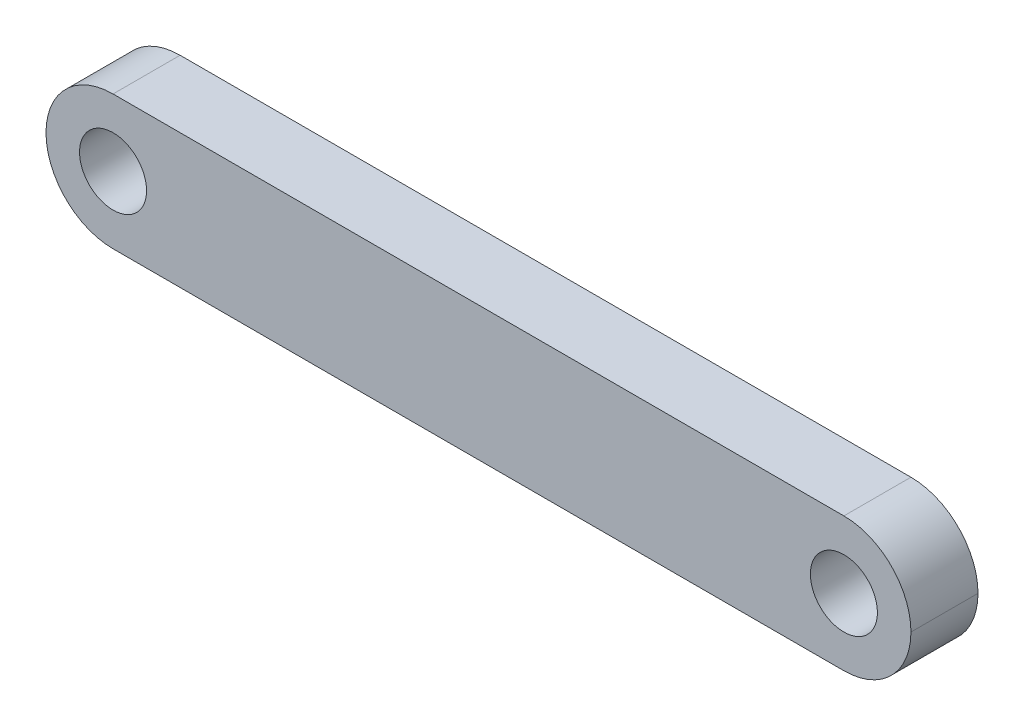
ISO-10303-21;
HEADER;
FILE_DESCRIPTION(('STEP AP214'),'2;1');
FILE_NAME('part.step','',(''),(''),'','','');
FILE_SCHEMA(('AUTOMOTIVE_DESIGN { 1 0 10303 214 1 1 1 1 }'));
ENDSEC;
DATA;
#1=APPLICATION_CONTEXT('core data for automotive mechanical design processes');
#2=APPLICATION_PROTOCOL_DEFINITION('international standard','automotive_design',2000,#1);
#3=PRODUCT_CONTEXT('',#1,'mechanical');
#4=PRODUCT('Part','Part','',(#3));
#5=PRODUCT_RELATED_PRODUCT_CATEGORY('part','',(#4));
#6=PRODUCT_DEFINITION_FORMATION('','',#4);
#7=PRODUCT_DEFINITION_CONTEXT('part definition',#1,'design');
#8=PRODUCT_DEFINITION('design','',#6,#7);
#9=PRODUCT_DEFINITION_SHAPE('','',#8);
#10=(LENGTH_UNIT() NAMED_UNIT(*) SI_UNIT(.MILLI.,.METRE.));
#11=(NAMED_UNIT(*) PLANE_ANGLE_UNIT() SI_UNIT($,.RADIAN.));
#12=(NAMED_UNIT(*) SI_UNIT($,.STERADIAN.) SOLID_ANGLE_UNIT());
#13=UNCERTAINTY_MEASURE_WITH_UNIT(LENGTH_MEASURE(1.E-05),#10,'distance_accuracy_value','');
#14=(GEOMETRIC_REPRESENTATION_CONTEXT(3) GLOBAL_UNCERTAINTY_ASSIGNED_CONTEXT((#13)) GLOBAL_UNIT_ASSIGNED_CONTEXT((#10,
#11,#12)) REPRESENTATION_CONTEXT('',''));
#15=CARTESIAN_POINT('',(0.,0.,0.));
#16=DIRECTION('',(0.,0.,1.));
#17=DIRECTION('',(1.,0.,0.));
#18=AXIS2_PLACEMENT_3D('',#15,#16,#17);
#19=CARTESIAN_POINT('',(0.,0.,10.));
#20=DIRECTION('',(0.,1.,0.));
#21=DIRECTION('',(0.,0.,1.));
#22=AXIS2_PLACEMENT_3D('',#19,#20,#21);
#23=PLANE('',#22);
#24=DIRECTION('',(1.,0.,0.));
#25=VECTOR('',#24,1.);
#26=CARTESIAN_POINT('',(0.,0.,0.));
#27=LINE('',#26,#25);
#28=CARTESIAN_POINT('',(10.,0.,0.));
#29=VERTEX_POINT('',#28);
#30=CARTESIAN_POINT('',(119.,0.,0.));
#31=VERTEX_POINT('',#30);
#32=EDGE_CURVE('E92',#29,#31,#27,.T.);
#33=ORIENTED_EDGE('',*,*,#32,.T.);
#34=DIRECTION('',(0.,0.,-1.));
#35=VECTOR('',#34,1.);
#36=CARTESIAN_POINT('',(119.,0.,10.));
#37=LINE('',#36,#35);
#38=CARTESIAN_POINT('',(119.,0.,10.));
#39=VERTEX_POINT('',#38);
#40=EDGE_CURVE('E134',#31,#39,#37,.F.);
#41=ORIENTED_EDGE('',*,*,#40,.T.);
#42=DIRECTION('',(1.,0.,0.));
#43=VECTOR('',#42,1.);
#44=CARTESIAN_POINT('',(0.,0.,10.));
#45=LINE('',#44,#43);
#46=CARTESIAN_POINT('',(10.,0.,10.));
#47=VERTEX_POINT('',#46);
#48=EDGE_CURVE('E122',#47,#39,#45,.T.);
#49=ORIENTED_EDGE('',*,*,#48,.F.);
#50=DIRECTION('',(0.,0.,-1.));
#51=VECTOR('',#50,1.);
#52=CARTESIAN_POINT('',(10.,0.,10.));
#53=LINE('',#52,#51);
#54=EDGE_CURVE('E132',#47,#29,#53,.T.);
#55=ORIENTED_EDGE('',*,*,#54,.T.);
#56=EDGE_LOOP('',(#33,#41,#49,#55));
#57=FACE_BOUND('',#56,.T.);
#58=ADVANCED_FACE('F33',(#57),#23,.F.);
#59=CARTESIAN_POINT('',(0.,20.,10.));
#60=DIRECTION('',(0.,-1.,0.));
#61=DIRECTION('',(0.,0.,-1.));
#62=AXIS2_PLACEMENT_3D('',#59,#60,#61);
#63=PLANE('',#62);
#64=DIRECTION('',(-1.,0.,0.));
#65=VECTOR('',#64,1.);
#66=CARTESIAN_POINT('',(0.,20.,10.));
#67=LINE('',#66,#65);
#68=CARTESIAN_POINT('',(119.,20.,10.));
#69=VERTEX_POINT('',#68);
#70=CARTESIAN_POINT('',(10.,20.,10.));
#71=VERTEX_POINT('',#70);
#72=EDGE_CURVE('E103',#69,#71,#67,.T.);
#73=ORIENTED_EDGE('',*,*,#72,.F.);
#74=DIRECTION('',(0.,0.,-1.));
#75=VECTOR('',#74,1.);
#76=CARTESIAN_POINT('',(119.,20.,10.));
#77=LINE('',#76,#75);
#78=CARTESIAN_POINT('',(119.,20.,0.));
#79=VERTEX_POINT('',#78);
#80=EDGE_CURVE('E11',#69,#79,#77,.T.);
#81=ORIENTED_EDGE('',*,*,#80,.T.);
#82=DIRECTION('',(-1.,0.,0.));
#83=VECTOR('',#82,1.);
#84=CARTESIAN_POINT('',(0.,20.,0.));
#85=LINE('',#84,#83);
#86=CARTESIAN_POINT('',(10.,20.,0.));
#87=VERTEX_POINT('',#86);
#88=EDGE_CURVE('E125',#79,#87,#85,.T.);
#89=ORIENTED_EDGE('',*,*,#88,.T.);
#90=DIRECTION('',(0.,0.,-1.));
#91=VECTOR('',#90,1.);
#92=CARTESIAN_POINT('',(10.,20.,10.));
#93=LINE('',#92,#91);
#94=EDGE_CURVE('E42',#87,#71,#93,.F.);
#95=ORIENTED_EDGE('',*,*,#94,.T.);
#96=EDGE_LOOP('',(#73,#81,#89,#95));
#97=FACE_BOUND('',#96,.T.);
#98=ADVANCED_FACE('F156',(#97),#63,.F.);
#99=CARTESIAN_POINT('',(0.,0.,10.));
#100=DIRECTION('',(0.,0.,-1.));
#101=DIRECTION('',(-1.,0.,0.));
#102=AXIS2_PLACEMENT_3D('',#99,#100,#101);
#103=PLANE('',#102);
#104=CARTESIAN_POINT('',(119.,10.,10.));
#105=DIRECTION('',(0.,0.,1.));
#106=DIRECTION('',(1.,0.,0.));
#107=AXIS2_PLACEMENT_3D('',#104,#105,#106);
#108=CIRCLE('',#107,4.99999999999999);
#109=CARTESIAN_POINT('',(124.,10.,10.));
#110=VERTEX_POINT('',#109);
#111=EDGE_CURVE('E119',#110,#110,#108,.T.);
#112=ORIENTED_EDGE('',*,*,#111,.F.);
#113=EDGE_LOOP('',(#112));
#114=FACE_BOUND('',#113,.T.);
#115=CARTESIAN_POINT('',(10.,10.,10.));
#116=DIRECTION('',(0.,0.,1.));
#117=DIRECTION('',(1.,0.,0.));
#118=AXIS2_PLACEMENT_3D('',#115,#116,#117);
#119=CIRCLE('',#118,5.);
#120=CARTESIAN_POINT('',(15.,10.,10.));
#121=VERTEX_POINT('',#120);
#122=EDGE_CURVE('E111',#121,#121,#119,.T.);
#123=ORIENTED_EDGE('',*,*,#122,.F.);
#124=EDGE_LOOP('',(#123));
#125=FACE_BOUND('',#124,.T.);
#126=ORIENTED_EDGE('',*,*,#48,.T.);
#127=CARTESIAN_POINT('',(119.,10.,10.));
#128=DIRECTION('',(0.,0.,-1.));
#129=DIRECTION('',(-1.,0.,0.));
#130=AXIS2_PLACEMENT_3D('',#127,#128,#129);
#131=CIRCLE('',#130,10.);
#132=CARTESIAN_POINT('',(129.,10.,10.));
#133=VERTEX_POINT('',#132);
#134=EDGE_CURVE('E141',#39,#133,#131,.F.);
#135=ORIENTED_EDGE('',*,*,#134,.T.);
#136=CARTESIAN_POINT('',(119.,10.,10.));
#137=DIRECTION('',(0.,0.,-1.));
#138=DIRECTION('',(-1.,0.,0.));
#139=AXIS2_PLACEMENT_3D('',#136,#137,#138);
#140=CIRCLE('',#139,10.);
#141=EDGE_CURVE('E56',#133,#69,#140,.F.);
#142=ORIENTED_EDGE('',*,*,#141,.T.);
#143=ORIENTED_EDGE('',*,*,#72,.T.);
#144=CARTESIAN_POINT('',(10.,10.,10.));
#145=DIRECTION('',(0.,0.,-1.));
#146=DIRECTION('',(-1.,0.,0.));
#147=AXIS2_PLACEMENT_3D('',#144,#145,#146);
#148=CIRCLE('',#147,10.);
#149=CARTESIAN_POINT('',(0.,10.,10.));
#150=VERTEX_POINT('',#149);
#151=EDGE_CURVE('E137',#71,#150,#148,.F.);
#152=ORIENTED_EDGE('',*,*,#151,.T.);
#153=CARTESIAN_POINT('',(10.,10.,10.));
#154=DIRECTION('',(0.,0.,-1.));
#155=DIRECTION('',(-1.,0.,0.));
#156=AXIS2_PLACEMENT_3D('',#153,#154,#155);
#157=CIRCLE('',#156,10.);
#158=EDGE_CURVE('E106',#150,#47,#157,.F.);
#159=ORIENTED_EDGE('',*,*,#158,.T.);
#160=EDGE_LOOP('',(#126,#135,#142,#143,#152,#159));
#161=FACE_BOUND('',#160,.T.);
#162=ADVANCED_FACE('F143',(#114,#125,#161),#103,.F.);
#163=CARTESIAN_POINT('',(0.,0.,0.));
#164=DIRECTION('',(0.,0.,-1.));
#165=DIRECTION('',(-1.,0.,0.));
#166=AXIS2_PLACEMENT_3D('',#163,#164,#165);
#167=PLANE('',#166);
#168=CARTESIAN_POINT('',(119.,10.,0.));
#169=DIRECTION('',(0.,0.,1.));
#170=DIRECTION('',(1.,0.,0.));
#171=AXIS2_PLACEMENT_3D('',#168,#169,#170);
#172=CIRCLE('',#171,4.99999999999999);
#173=CARTESIAN_POINT('',(124.,10.,0.));
#174=VERTEX_POINT('',#173);
#175=EDGE_CURVE('E116',#174,#174,#172,.T.);
#176=ORIENTED_EDGE('',*,*,#175,.T.);
#177=EDGE_LOOP('',(#176));
#178=FACE_BOUND('',#177,.T.);
#179=CARTESIAN_POINT('',(10.,10.,0.));
#180=DIRECTION('',(0.,0.,1.));
#181=DIRECTION('',(1.,0.,0.));
#182=AXIS2_PLACEMENT_3D('',#179,#180,#181);
#183=CIRCLE('',#182,5.);
#184=CARTESIAN_POINT('',(15.,10.,0.));
#185=VERTEX_POINT('',#184);
#186=EDGE_CURVE('E108',#185,#185,#183,.T.);
#187=ORIENTED_EDGE('',*,*,#186,.T.);
#188=EDGE_LOOP('',(#187));
#189=FACE_BOUND('',#188,.T.);
#190=CARTESIAN_POINT('',(119.,10.,0.));
#191=DIRECTION('',(0.,0.,-1.));
#192=DIRECTION('',(-1.,0.,0.));
#193=AXIS2_PLACEMENT_3D('',#190,#191,#192);
#194=CIRCLE('',#193,10.);
#195=CARTESIAN_POINT('',(129.,10.,0.));
#196=VERTEX_POINT('',#195);
#197=EDGE_CURVE('E97',#79,#196,#194,.T.);
#198=ORIENTED_EDGE('',*,*,#197,.T.);
#199=CARTESIAN_POINT('',(119.,10.,0.));
#200=DIRECTION('',(0.,0.,-1.));
#201=DIRECTION('',(-1.,0.,0.));
#202=AXIS2_PLACEMENT_3D('',#199,#200,#201);
#203=CIRCLE('',#202,10.);
#204=EDGE_CURVE('E130',#196,#31,#203,.T.);
#205=ORIENTED_EDGE('',*,*,#204,.T.);
#206=ORIENTED_EDGE('',*,*,#32,.F.);
#207=CARTESIAN_POINT('',(10.,10.,0.));
#208=DIRECTION('',(0.,0.,-1.));
#209=DIRECTION('',(-1.,0.,0.));
#210=AXIS2_PLACEMENT_3D('',#207,#208,#209);
#211=CIRCLE('',#210,10.);
#212=CARTESIAN_POINT('',(0.,10.,0.));
#213=VERTEX_POINT('',#212);
#214=EDGE_CURVE('E86',#29,#213,#211,.T.);
#215=ORIENTED_EDGE('',*,*,#214,.T.);
#216=CARTESIAN_POINT('',(10.,10.,0.));
#217=DIRECTION('',(0.,0.,-1.));
#218=DIRECTION('',(-1.,0.,0.));
#219=AXIS2_PLACEMENT_3D('',#216,#217,#218);
#220=CIRCLE('',#219,10.);
#221=EDGE_CURVE('E90',#213,#87,#220,.T.);
#222=ORIENTED_EDGE('',*,*,#221,.T.);
#223=ORIENTED_EDGE('',*,*,#88,.F.);
#224=EDGE_LOOP('',(#198,#205,#206,#215,#222,#223));
#225=FACE_BOUND('',#224,.T.);
#226=ADVANCED_FACE('F88',(#178,#189,#225),#167,.T.);
#227=CARTESIAN_POINT('',(119.,10.,10.));
#228=DIRECTION('',(0.,0.,-1.));
#229=DIRECTION('',(-1.,0.,0.));
#230=AXIS2_PLACEMENT_3D('',#227,#228,#229);
#231=CYLINDRICAL_SURFACE('',#230,10.);
#232=ORIENTED_EDGE('',*,*,#80,.F.);
#233=ORIENTED_EDGE('',*,*,#141,.F.);
#234=DIRECTION('',(0.,0.,-1.));
#235=VECTOR('',#234,1.);
#236=CARTESIAN_POINT('',(129.,10.,10.));
#237=LINE('',#236,#235);
#238=EDGE_CURVE('E107',#196,#133,#237,.F.);
#239=ORIENTED_EDGE('',*,*,#238,.F.);
#240=ORIENTED_EDGE('',*,*,#197,.F.);
#241=EDGE_LOOP('',(#232,#233,#239,#240));
#242=FACE_BOUND('',#241,.T.);
#243=ADVANCED_FACE('F150',(#242),#231,.T.);
#244=CARTESIAN_POINT('',(119.,10.,10.));
#245=DIRECTION('',(0.,0.,-1.));
#246=DIRECTION('',(-1.,0.,0.));
#247=AXIS2_PLACEMENT_3D('',#244,#245,#246);
#248=CYLINDRICAL_SURFACE('',#247,10.);
#249=ORIENTED_EDGE('',*,*,#134,.F.);
#250=ORIENTED_EDGE('',*,*,#40,.F.);
#251=ORIENTED_EDGE('',*,*,#204,.F.);
#252=ORIENTED_EDGE('',*,*,#238,.T.);
#253=EDGE_LOOP('',(#249,#250,#251,#252));
#254=FACE_BOUND('',#253,.T.);
#255=ADVANCED_FACE('F153',(#254),#248,.T.);
#256=CARTESIAN_POINT('',(10.,10.,10.));
#257=DIRECTION('',(0.,0.,-1.));
#258=DIRECTION('',(-1.,0.,0.));
#259=AXIS2_PLACEMENT_3D('',#256,#257,#258);
#260=CYLINDRICAL_SURFACE('',#259,10.);
#261=DIRECTION('',(0.,0.,-1.));
#262=VECTOR('',#261,1.);
#263=CARTESIAN_POINT('',(0.,10.,10.));
#264=LINE('',#263,#262);
#265=EDGE_CURVE('E37',#150,#213,#264,.T.);
#266=ORIENTED_EDGE('',*,*,#265,.F.);
#267=ORIENTED_EDGE('',*,*,#151,.F.);
#268=ORIENTED_EDGE('',*,*,#94,.F.);
#269=ORIENTED_EDGE('',*,*,#221,.F.);
#270=EDGE_LOOP('',(#266,#267,#268,#269));
#271=FACE_BOUND('',#270,.T.);
#272=ADVANCED_FACE('F35',(#271),#260,.T.);
#273=CARTESIAN_POINT('',(10.,10.,10.));
#274=DIRECTION('',(0.,0.,-1.));
#275=DIRECTION('',(-1.,0.,0.));
#276=AXIS2_PLACEMENT_3D('',#273,#274,#275);
#277=CYLINDRICAL_SURFACE('',#276,10.);
#278=ORIENTED_EDGE('',*,*,#158,.F.);
#279=ORIENTED_EDGE('',*,*,#265,.T.);
#280=ORIENTED_EDGE('',*,*,#214,.F.);
#281=ORIENTED_EDGE('',*,*,#54,.F.);
#282=EDGE_LOOP('',(#278,#279,#280,#281));
#283=FACE_BOUND('',#282,.T.);
#284=ADVANCED_FACE('F105',(#283),#277,.T.);
#285=CARTESIAN_POINT('',(10.,10.,0.));
#286=DIRECTION('',(0.,0.,1.));
#287=DIRECTION('',(1.,0.,0.));
#288=AXIS2_PLACEMENT_3D('',#285,#286,#287);
#289=CYLINDRICAL_SURFACE('',#288,5.);
#290=ORIENTED_EDGE('',*,*,#186,.F.);
#291=EDGE_LOOP('',(#290));
#292=FACE_BOUND('',#291,.T.);
#293=ORIENTED_EDGE('',*,*,#122,.T.);
#294=EDGE_LOOP('',(#293));
#295=FACE_BOUND('',#294,.T.);
#296=ADVANCED_FACE('F168',(#292,#295),#289,.F.);
#297=CARTESIAN_POINT('',(119.,10.,0.));
#298=DIRECTION('',(0.,0.,1.));
#299=DIRECTION('',(1.,0.,0.));
#300=AXIS2_PLACEMENT_3D('',#297,#298,#299);
#301=CYLINDRICAL_SURFACE('',#300,4.99999999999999);
#302=ORIENTED_EDGE('',*,*,#175,.F.);
#303=EDGE_LOOP('',(#302));
#304=FACE_BOUND('',#303,.T.);
#305=ORIENTED_EDGE('',*,*,#111,.T.);
#306=EDGE_LOOP('',(#305));
#307=FACE_BOUND('',#306,.T.);
#308=ADVANCED_FACE('F173',(#304,#307),#301,.F.);
#309=CLOSED_SHELL('',(#58,#98,#162,#226,#243,#255,#272,#284,#296,#308));
#310=MANIFOLD_SOLID_BREP('B2',#309);
#311=ADVANCED_BREP_SHAPE_REPRESENTATION('',(#18,#310),#14);
#312=SHAPE_DEFINITION_REPRESENTATION(#9,#311);
ENDSEC;
END-ISO-10303-21;
